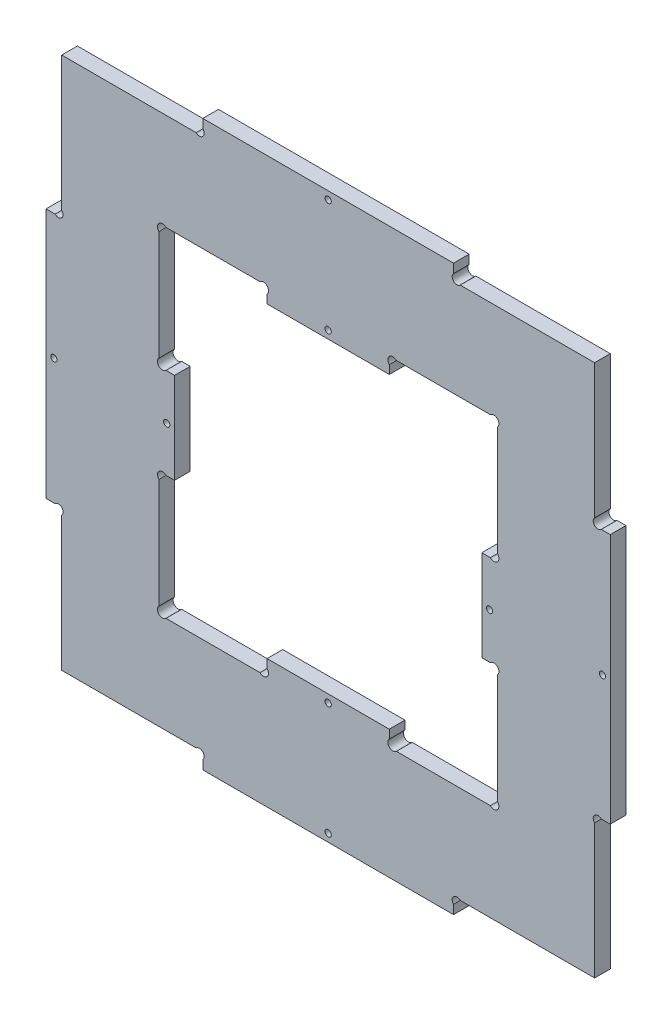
from build123d import *

# Parameters (mm, degrees)
ESQUISSE1_R        = 1
BOSS_EXTRU_1_DEPTH = 5


with BuildPart() as part:
    # Esquisse1 → Boss.-Extru.1 (new body)
    with BuildSketch(Plane.XY):
        with BuildLine():
            Line((71.16372654, -114.058527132), (71.16372654, -111.179847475))
            ThreePointArc((71.16372654, -111.179847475), (71.16372654, -109.058527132), (73.285046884, -109.058527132))
            Line((73.285046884, -109.058527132), (116.16372654, -109.058527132))
            Line((116.16372654, -109.058527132), (116.16372654, -66.179847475))
            ThreePointArc((116.16372654, -66.179847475), (116.16372654, -64.058527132), (118.285046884, -64.058527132))
            Line((118.285046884, -64.058527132), (121.16372654, -64.058527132))
            Line((121.16372654, -64.058527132), (121.16372654, 15.941472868))
            Line((121.16372654, 15.941472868), (118.285046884, 15.941472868))
            ThreePointArc((118.285046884, 15.941472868), (116.16372654, 15.941472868), (116.16372654, 18.062793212))
            Line((116.16372654, 18.062793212), (116.16372654, 60.941472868))
            Line((116.16372654, 60.941472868), (73.285046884, 60.941472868))
            ThreePointArc((73.285046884, 60.941472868), (71.16372654, 60.941472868), (71.16372654, 63.062793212))
            Line((71.16372654, 63.062793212), (71.16372654, 65.941472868))
            Line((71.16372654, 65.941472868), (-8.83627346, 65.941472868))
            Line((-8.83627346, 65.941472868), (-8.83627346, 63.062793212))
            ThreePointArc((-8.83627346, 63.062793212), (-8.83627346, 60.941472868), (-10.957593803, 60.941472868))
            Line((-10.957593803, 60.941472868), (-53.83627346, 60.941472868))
            Line((-53.83627346, 60.941472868), (-53.83627346, 18.062793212))
            ThreePointArc((-53.83627346, 18.062793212), (-53.83627346, 15.941472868), (-55.957593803, 15.941472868))
            Line((-55.957593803, 15.941472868), (-58.83627346, 15.941472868))
            Line((-58.83627346, 15.941472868), (-58.83627346, -64.058527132))
            Line((-58.83627346, -64.058527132), (-55.957593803, -64.058527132))
            ThreePointArc((-55.957593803, -64.058527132), (-53.83627346, -64.058527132), (-53.83627346, -66.179847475))
            Line((-53.83627346, -66.179847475), (-53.83627346, -109.058527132))
            Line((-53.83627346, -109.058527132), (-10.957593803, -109.058527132))
            ThreePointArc((-10.957593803, -109.058527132), (-8.83627346, -109.058527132), (-8.83627346, -111.179847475))
            Line((-8.83627346, -111.179847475), (-8.83627346, -114.058527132))
            Line((-8.83627346, -114.058527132), (71.16372654, -114.058527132))
        make_face()
        with Locations((31.16372654, -75.558527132)):
            Circle(ESQUISSE1_R, mode=Mode.SUBTRACT)
        with Locations((-20.33627346, -24.058527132)):
            Circle(ESQUISSE1_R, mode=Mode.SUBTRACT)
        with Locations(Location((31.16372654, 27.441472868, 0), (0, 0, 180))):
            Circle(ESQUISSE1_R, mode=Mode.SUBTRACT)
        with Locations(Location((82.66372654, -24.058527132, 0), (0, 0, 180))):
            Circle(ESQUISSE1_R, mode=Mode.SUBTRACT)
        with Locations((-56.33627346, -24.058527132)):
            Circle(ESQUISSE1_R, mode=Mode.SUBTRACT)
        with Locations((31.16372654, 63.441472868)):
            Circle(ESQUISSE1_R, mode=Mode.SUBTRACT)
        with Locations((118.66372654, -24.058527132)):
            Circle(ESQUISSE1_R, mode=Mode.SUBTRACT)
        with Locations((31.16372654, -111.558527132)):
            Circle(ESQUISSE1_R, mode=Mode.SUBTRACT)
        with BuildLine():
            Line((11.66372654, 24.941472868), (11.66372654, 27.678731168))
            ThreePointArc((11.66372654, 27.678731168), (11.66372654, 29.941472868), (9.40098484, 29.941472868))
            Line((9.40098484, 29.941472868), (-20.57353176, 29.941472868))
            ThreePointArc((-20.57353176, 29.941472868), (-22.83627346, 29.941472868), (-22.83627346, 27.678731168))
            Line((-22.83627346, 27.678731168), (-22.83627346, -7.295785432))
            ThreePointArc((-22.83627346, -7.295785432), (-22.83627346, -9.558527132), (-20.57353176, -9.558527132))
            Line((-20.57353176, -9.558527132), (-17.83627346, -9.558527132))
            Line((-17.83627346, -9.558527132), (-17.83627346, -38.558527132))
            Line((-17.83627346, -38.558527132), (-20.57353176, -38.558527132))
            ThreePointArc((-20.57353176, -38.558527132), (-22.83627346, -38.558527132), (-22.83627346, -40.821268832))
            Line((-22.83627346, -40.821268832), (-22.83627346, -75.795785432))
            ThreePointArc((-22.83627346, -75.795785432), (-22.83627346, -78.058527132), (-20.57353176, -78.058527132))
            Line((-20.57353176, -78.058527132), (9.40098484, -78.058527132))
            ThreePointArc((9.40098484, -78.058527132), (11.66372654, -78.058527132), (11.66372654, -75.795785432))
            Line((11.66372654, -75.795785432), (11.66372654, -73.058527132))
            Line((11.66372654, -73.058527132), (50.66372654, -73.058527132))
            Line((50.66372654, -73.058527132), (50.66372654, -75.795785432))
            ThreePointArc((50.66372654, -75.795785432), (50.66372654, -78.058527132), (52.92646824, -78.058527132))
            Line((52.92646824, -78.058527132), (82.90098484, -78.058527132))
            ThreePointArc((82.90098484, -78.058527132), (85.16372654, -78.058527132), (85.16372654, -75.795785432))
            Line((85.16372654, -75.795785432), (85.16372654, -40.821268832))
            ThreePointArc((85.16372654, -40.821268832), (85.16372654, -38.558527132), (82.90098484, -38.558527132))
            Line((82.90098484, -38.558527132), (80.16372654, -38.558527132))
            Line((80.16372654, -38.558527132), (80.16372654, -9.558527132))
            Line((80.16372654, -9.558527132), (82.90098484, -9.558527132))
            ThreePointArc((82.90098484, -9.558527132), (85.16372654, -9.558527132), (85.16372654, -7.295785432))
            Line((85.16372654, -7.295785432), (85.16372654, 27.678731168))
            ThreePointArc((85.16372654, 27.678731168), (85.16372654, 29.941472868), (82.90098484, 29.941472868))
            Line((82.90098484, 29.941472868), (52.92646824, 29.941472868))
            ThreePointArc((52.92646824, 29.941472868), (50.66372654, 29.941472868), (50.66372654, 27.678731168))
            Line((50.66372654, 27.678731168), (50.66372654, 24.941472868))
            Line((50.66372654, 24.941472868), (11.66372654, 24.941472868))
        make_face(mode=Mode.SUBTRACT)
    extrude(amount=BOSS_EXTRU_1_DEPTH)


solid = part.part
